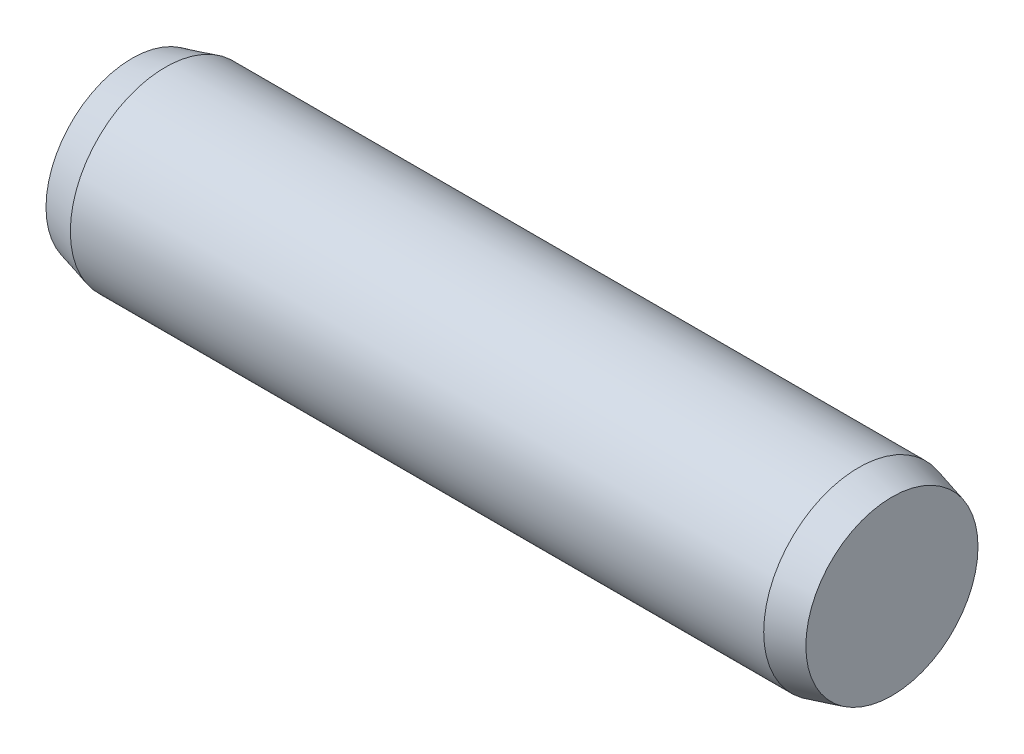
from build123d import *


with BuildPart() as part:
    # Sketch1 → Base-Revolve (revolve)
    with BuildSketch(Plane.XY, mode=Mode.PRIVATE) as base_revolve_sk:
        Polygon((0, 0), (8, 0), (8, 0.906217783), (7.65, 1), (0.35, 1), (0, 0.906217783), align=None)
    revolve(base_revolve_sk.sketch.rotate(Axis((-6.35, 0, 0), (1, 0, 0)), 90), axis=Axis((-6.35, 0, 0), (1, 0, 0)))


solid = part.part
